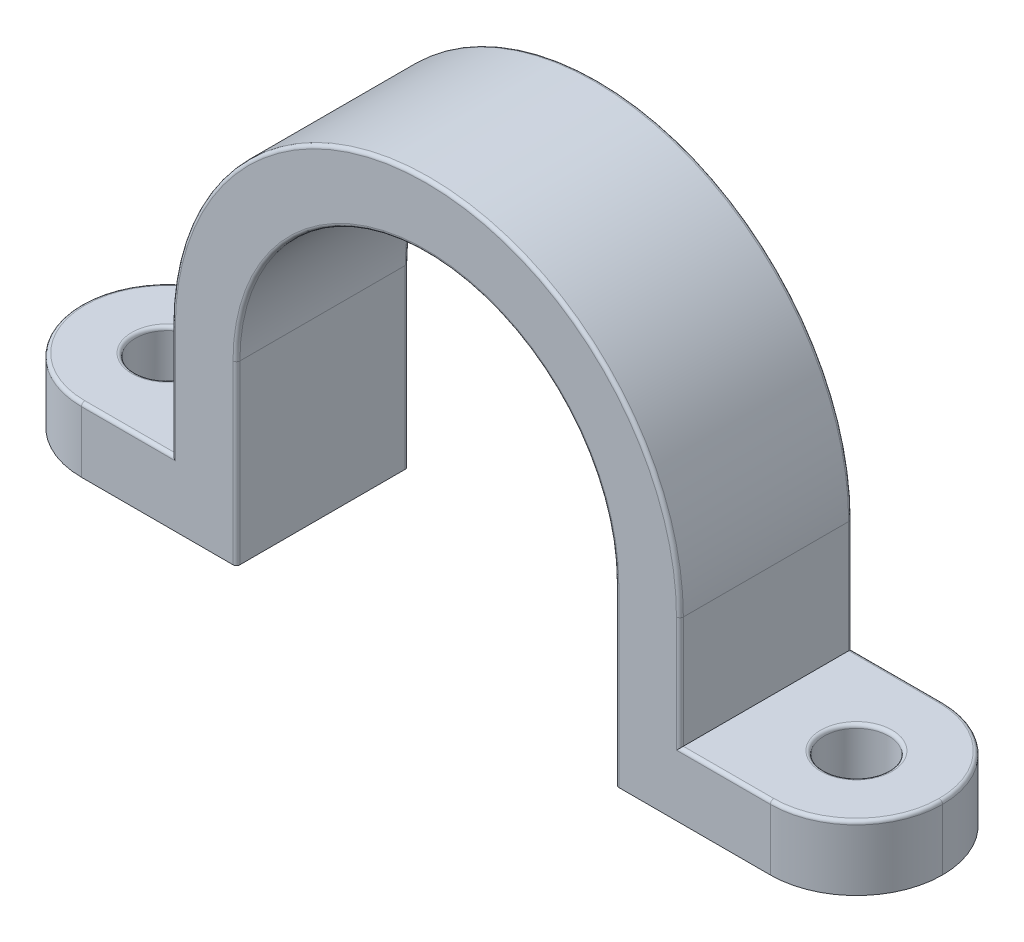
ISO-10303-21;
HEADER;
FILE_DESCRIPTION(('STEP AP214'),'2;1');
FILE_NAME('part.step','',(''),(''),'','','');
FILE_SCHEMA(('AUTOMOTIVE_DESIGN { 1 0 10303 214 1 1 1 1 }'));
ENDSEC;
DATA;
#1=APPLICATION_CONTEXT('core data for automotive mechanical design processes');
#2=APPLICATION_PROTOCOL_DEFINITION('international standard','automotive_design',2000,#1);
#3=PRODUCT_CONTEXT('',#1,'mechanical');
#4=PRODUCT('Part','Part','',(#3));
#5=PRODUCT_RELATED_PRODUCT_CATEGORY('part','',(#4));
#6=PRODUCT_DEFINITION_FORMATION('','',#4);
#7=PRODUCT_DEFINITION_CONTEXT('part definition',#1,'design');
#8=PRODUCT_DEFINITION('design','',#6,#7);
#9=PRODUCT_DEFINITION_SHAPE('','',#8);
#10=(LENGTH_UNIT() NAMED_UNIT(*) SI_UNIT(.MILLI.,.METRE.));
#11=(NAMED_UNIT(*) PLANE_ANGLE_UNIT() SI_UNIT($,.RADIAN.));
#12=(NAMED_UNIT(*) SI_UNIT($,.STERADIAN.) SOLID_ANGLE_UNIT());
#13=UNCERTAINTY_MEASURE_WITH_UNIT(LENGTH_MEASURE(1.E-05),#10,'distance_accuracy_value','');
#14=(GEOMETRIC_REPRESENTATION_CONTEXT(3) GLOBAL_UNCERTAINTY_ASSIGNED_CONTEXT((#13)) GLOBAL_UNIT_ASSIGNED_CONTEXT((#10,
#11,#12)) REPRESENTATION_CONTEXT('',''));
#15=CARTESIAN_POINT('',(0.,0.,0.));
#16=DIRECTION('',(0.,0.,1.));
#17=DIRECTION('',(1.,0.,0.));
#18=AXIS2_PLACEMENT_3D('',#15,#16,#17);
#19=CARTESIAN_POINT('',(-31.75,4.7625,-6.35));
#20=DIRECTION('',(0.,1.,0.));
#21=DIRECTION('',(0.,0.,1.));
#22=AXIS2_PLACEMENT_3D('',#19,#20,#21);
#23=PLANE('',#22);
#24=CARTESIAN_POINT('',(-25.4,4.7625,0.));
#25=DIRECTION('',(0.,1.,0.));
#26=DIRECTION('',(0.,0.,1.));
#27=AXIS2_PLACEMENT_3D('',#24,#25,#26);
#28=CIRCLE('',#27,2.63525);
#29=CARTESIAN_POINT('',(-25.4,4.7625,2.63525));
#30=VERTEX_POINT('',#29);
#31=EDGE_CURVE('E333',#30,#30,#28,.F.);
#32=ORIENTED_EDGE('',*,*,#31,.T.);
#33=EDGE_LOOP('',(#32));
#34=FACE_BOUND('',#33,.T.);
#35=DIRECTION('',(0.,0.,1.));
#36=VECTOR('',#35,1.);
#37=CARTESIAN_POINT('',(-18.7325,4.7625,-6.35));
#38=LINE('',#37,#36);
#39=CARTESIAN_POINT('',(-18.7325,4.7625,-6.096));
#40=VERTEX_POINT('',#39);
#41=CARTESIAN_POINT('',(-18.7325,4.7625,6.096));
#42=VERTEX_POINT('',#41);
#43=EDGE_CURVE('E434',#40,#42,#38,.T.);
#44=ORIENTED_EDGE('',*,*,#43,.F.);
#45=DIRECTION('',(-1.,0.,0.));
#46=VECTOR('',#45,1.);
#47=CARTESIAN_POINT('',(-31.75,4.7625,-6.096));
#48=LINE('',#47,#46);
#49=CARTESIAN_POINT('',(-25.4,4.7625,-6.096));
#50=VERTEX_POINT('',#49);
#51=EDGE_CURVE('E331',#40,#50,#48,.T.);
#52=ORIENTED_EDGE('',*,*,#51,.T.);
#53=CARTESIAN_POINT('',(-25.4,4.7625,0.));
#54=DIRECTION('',(0.,1.,0.));
#55=DIRECTION('',(0.,0.,1.));
#56=AXIS2_PLACEMENT_3D('',#53,#54,#55);
#57=CIRCLE('',#56,6.096);
#58=CARTESIAN_POINT('',(-31.496,4.7625,0.));
#59=VERTEX_POINT('',#58);
#60=EDGE_CURVE('E329',#50,#59,#57,.T.);
#61=ORIENTED_EDGE('',*,*,#60,.T.);
#62=CARTESIAN_POINT('',(-25.4,4.7625,0.));
#63=DIRECTION('',(0.,1.,0.));
#64=DIRECTION('',(0.,0.,1.));
#65=AXIS2_PLACEMENT_3D('',#62,#63,#64);
#66=CIRCLE('',#65,6.096);
#67=CARTESIAN_POINT('',(-25.4,4.7625,6.096));
#68=VERTEX_POINT('',#67);
#69=EDGE_CURVE('E327',#59,#68,#66,.T.);
#70=ORIENTED_EDGE('',*,*,#69,.T.);
#71=DIRECTION('',(-1.,0.,0.));
#72=VECTOR('',#71,1.);
#73=CARTESIAN_POINT('',(-18.7325,4.7625,6.096));
#74=LINE('',#73,#72);
#75=EDGE_CURVE('E325',#68,#42,#74,.F.);
#76=ORIENTED_EDGE('',*,*,#75,.T.);
#77=EDGE_LOOP('',(#44,#52,#61,#70,#76));
#78=FACE_BOUND('',#77,.T.);
#79=ADVANCED_FACE('F40',(#34,#78),#23,.T.);
#80=CARTESIAN_POINT('',(-18.7325,4.7625,-6.35));
#81=DIRECTION('',(-1.,0.,0.));
#82=DIRECTION('',(0.,0.,1.));
#83=AXIS2_PLACEMENT_3D('',#80,#81,#82);
#84=PLANE('',#83);
#85=DIRECTION('',(0.,0.,1.));
#86=VECTOR('',#85,1.);
#87=CARTESIAN_POINT('',(-18.7325,13.0175,-6.35));
#88=LINE('',#87,#86);
#89=CARTESIAN_POINT('',(-18.7325,13.0175,-6.096));
#90=VERTEX_POINT('',#89);
#91=CARTESIAN_POINT('',(-18.7325,13.0175,6.096));
#92=VERTEX_POINT('',#91);
#93=EDGE_CURVE('E437',#90,#92,#88,.T.);
#94=ORIENTED_EDGE('',*,*,#93,.F.);
#95=DIRECTION('',(0.,-1.,0.));
#96=VECTOR('',#95,1.);
#97=CARTESIAN_POINT('',(-18.7325,4.7625,-6.096));
#98=LINE('',#97,#96);
#99=EDGE_CURVE('E323',#90,#40,#98,.T.);
#100=ORIENTED_EDGE('',*,*,#99,.T.);
#101=ORIENTED_EDGE('',*,*,#43,.T.);
#102=DIRECTION('',(0.,-1.,0.));
#103=VECTOR('',#102,1.);
#104=CARTESIAN_POINT('',(-18.7325,13.0175,6.096));
#105=LINE('',#104,#103);
#106=EDGE_CURVE('E321',#42,#92,#105,.F.);
#107=ORIENTED_EDGE('',*,*,#106,.T.);
#108=EDGE_LOOP('',(#94,#100,#101,#107));
#109=FACE_BOUND('',#108,.T.);
#110=ADVANCED_FACE('F554',(#109),#84,.T.);
#111=CARTESIAN_POINT('',(0.,13.0175,-6.35));
#112=DIRECTION('',(0.,0.,1.));
#113=DIRECTION('',(1.,0.,0.));
#114=AXIS2_PLACEMENT_3D('',#111,#112,#113);
#115=CYLINDRICAL_SURFACE('',#114,18.7325);
#116=DIRECTION('',(0.,0.,1.));
#117=VECTOR('',#116,1.);
#118=CARTESIAN_POINT('',(18.7325,13.0175,-6.35));
#119=LINE('',#118,#117);
#120=CARTESIAN_POINT('',(18.7325,13.0175,-6.096));
#121=VERTEX_POINT('',#120);
#122=CARTESIAN_POINT('',(18.7325,13.0175,6.096));
#123=VERTEX_POINT('',#122);
#124=EDGE_CURVE('E440',#121,#123,#119,.T.);
#125=ORIENTED_EDGE('',*,*,#124,.F.);
#126=CARTESIAN_POINT('',(0.,13.0175,-6.096));
#127=DIRECTION('',(0.,0.,-1.));
#128=DIRECTION('',(-1.,0.,0.));
#129=AXIS2_PLACEMENT_3D('',#126,#127,#128);
#130=CIRCLE('',#129,18.7325);
#131=EDGE_CURVE('E11',#121,#90,#130,.F.);
#132=ORIENTED_EDGE('',*,*,#131,.T.);
#133=ORIENTED_EDGE('',*,*,#93,.T.);
#134=CARTESIAN_POINT('',(0.,13.0175,6.096));
#135=DIRECTION('',(0.,0.,-1.));
#136=DIRECTION('',(-1.,0.,0.));
#137=AXIS2_PLACEMENT_3D('',#134,#135,#136);
#138=CIRCLE('',#137,18.7325);
#139=EDGE_CURVE('E49',#92,#123,#138,.T.);
#140=ORIENTED_EDGE('',*,*,#139,.T.);
#141=EDGE_LOOP('',(#125,#132,#133,#140));
#142=FACE_BOUND('',#141,.T.);
#143=ADVANCED_FACE('F560',(#142),#115,.T.);
#144=CARTESIAN_POINT('',(18.7325,4.7625,-6.35));
#145=DIRECTION('',(1.,0.,0.));
#146=DIRECTION('',(0.,0.,-1.));
#147=AXIS2_PLACEMENT_3D('',#144,#145,#146);
#148=PLANE('',#147);
#149=DIRECTION('',(0.,0.,1.));
#150=VECTOR('',#149,1.);
#151=CARTESIAN_POINT('',(18.7325,4.7625,-6.35));
#152=LINE('',#151,#150);
#153=CARTESIAN_POINT('',(18.7325,4.7625,-6.096));
#154=VERTEX_POINT('',#153);
#155=CARTESIAN_POINT('',(18.7325,4.7625,6.096));
#156=VERTEX_POINT('',#155);
#157=EDGE_CURVE('E443',#154,#156,#152,.T.);
#158=ORIENTED_EDGE('',*,*,#157,.F.);
#159=DIRECTION('',(0.,1.,0.));
#160=VECTOR('',#159,1.);
#161=CARTESIAN_POINT('',(18.7325,4.7625,-6.096));
#162=LINE('',#161,#160);
#163=EDGE_CURVE('E319',#154,#121,#162,.T.);
#164=ORIENTED_EDGE('',*,*,#163,.T.);
#165=ORIENTED_EDGE('',*,*,#124,.T.);
#166=DIRECTION('',(0.,1.,0.));
#167=VECTOR('',#166,1.);
#168=CARTESIAN_POINT('',(18.7325,4.7625,6.096));
#169=LINE('',#168,#167);
#170=EDGE_CURVE('E317',#123,#156,#169,.F.);
#171=ORIENTED_EDGE('',*,*,#170,.T.);
#172=EDGE_LOOP('',(#158,#164,#165,#171));
#173=FACE_BOUND('',#172,.T.);
#174=ADVANCED_FACE('F568',(#173),#148,.T.);
#175=CARTESIAN_POINT('',(18.7325,4.7625,-6.35));
#176=DIRECTION('',(0.,1.,0.));
#177=DIRECTION('',(0.,0.,1.));
#178=AXIS2_PLACEMENT_3D('',#175,#176,#177);
#179=PLANE('',#178);
#180=CARTESIAN_POINT('',(25.4,4.7625,0.));
#181=DIRECTION('',(0.,1.,0.));
#182=DIRECTION('',(0.,0.,1.));
#183=AXIS2_PLACEMENT_3D('',#180,#181,#182);
#184=CIRCLE('',#183,2.63525);
#185=CARTESIAN_POINT('',(25.4,4.7625,2.63525));
#186=VERTEX_POINT('',#185);
#187=EDGE_CURVE('E282',#186,#186,#184,.F.);
#188=ORIENTED_EDGE('',*,*,#187,.T.);
#189=EDGE_LOOP('',(#188));
#190=FACE_BOUND('',#189,.T.);
#191=ORIENTED_EDGE('',*,*,#157,.T.);
#192=DIRECTION('',(-1.,0.,0.));
#193=VECTOR('',#192,1.);
#194=CARTESIAN_POINT('',(25.4,4.7625,6.096));
#195=LINE('',#194,#193);
#196=CARTESIAN_POINT('',(25.4,4.7625,6.096));
#197=VERTEX_POINT('',#196);
#198=EDGE_CURVE('E279',#156,#197,#195,.F.);
#199=ORIENTED_EDGE('',*,*,#198,.T.);
#200=CARTESIAN_POINT('',(25.4,4.7625,0.));
#201=DIRECTION('',(0.,1.,0.));
#202=DIRECTION('',(0.,0.,1.));
#203=AXIS2_PLACEMENT_3D('',#200,#201,#202);
#204=CIRCLE('',#203,6.096);
#205=CARTESIAN_POINT('',(31.496,4.7625,0.));
#206=VERTEX_POINT('',#205);
#207=EDGE_CURVE('E273',#197,#206,#204,.T.);
#208=ORIENTED_EDGE('',*,*,#207,.T.);
#209=CARTESIAN_POINT('',(25.4,4.7625,0.));
#210=DIRECTION('',(0.,1.,0.));
#211=DIRECTION('',(0.,0.,1.));
#212=AXIS2_PLACEMENT_3D('',#209,#210,#211);
#213=CIRCLE('',#212,6.096);
#214=CARTESIAN_POINT('',(25.4,4.7625,-6.096));
#215=VERTEX_POINT('',#214);
#216=EDGE_CURVE('E275',#206,#215,#213,.T.);
#217=ORIENTED_EDGE('',*,*,#216,.T.);
#218=DIRECTION('',(-1.,0.,0.));
#219=VECTOR('',#218,1.);
#220=CARTESIAN_POINT('',(18.7325,4.7625,-6.096));
#221=LINE('',#220,#219);
#222=EDGE_CURVE('E277',#215,#154,#221,.T.);
#223=ORIENTED_EDGE('',*,*,#222,.T.);
#224=EDGE_LOOP('',(#191,#199,#208,#217,#223));
#225=FACE_BOUND('',#224,.T.);
#226=ADVANCED_FACE('F572',(#190,#225),#179,.T.);
#227=CARTESIAN_POINT('',(13.97,0.,-6.35));
#228=DIRECTION('',(0.,-1.,0.));
#229=DIRECTION('',(0.,0.,-1.));
#230=AXIS2_PLACEMENT_3D('',#227,#228,#229);
#231=PLANE('',#230);
#232=CARTESIAN_POINT('',(25.4,0.,0.));
#233=DIRECTION('',(0.,-1.,0.));
#234=DIRECTION('',(0.,0.,-1.));
#235=AXIS2_PLACEMENT_3D('',#232,#233,#234);
#236=CIRCLE('',#235,2.63525);
#237=CARTESIAN_POINT('',(25.4,0.,-2.63525));
#238=VERTEX_POINT('',#237);
#239=EDGE_CURVE('E307',#238,#238,#236,.F.);
#240=ORIENTED_EDGE('',*,*,#239,.T.);
#241=EDGE_LOOP('',(#240));
#242=FACE_BOUND('',#241,.T.);
#243=DIRECTION('',(0.,0.,1.));
#244=VECTOR('',#243,1.);
#245=CARTESIAN_POINT('',(13.97,0.,-6.35));
#246=LINE('',#245,#244);
#247=CARTESIAN_POINT('',(13.97,0.,-6.096));
#248=VERTEX_POINT('',#247);
#249=CARTESIAN_POINT('',(13.97,0.,6.096));
#250=VERTEX_POINT('',#249);
#251=EDGE_CURVE('E446',#248,#250,#246,.T.);
#252=ORIENTED_EDGE('',*,*,#251,.F.);
#253=CARTESIAN_POINT('',(14.224,0.,-6.096));
#254=DIRECTION('',(0.,-1.,0.));
#255=DIRECTION('',(0.,0.,-1.));
#256=AXIS2_PLACEMENT_3D('',#253,#254,#255);
#257=CIRCLE('',#256,0.254);
#258=CARTESIAN_POINT('',(14.224,0.,-6.35));
#259=VERTEX_POINT('',#258);
#260=EDGE_CURVE('E218',#248,#259,#257,.T.);
#261=ORIENTED_EDGE('',*,*,#260,.T.);
#262=DIRECTION('',(1.,0.,0.));
#263=VECTOR('',#262,1.);
#264=CARTESIAN_POINT('',(13.97,0.,-6.35));
#265=LINE('',#264,#263);
#266=CARTESIAN_POINT('',(25.4,0.,-6.35));
#267=VERTEX_POINT('',#266);
#268=EDGE_CURVE('E210',#259,#267,#265,.T.);
#269=ORIENTED_EDGE('',*,*,#268,.T.);
#270=CARTESIAN_POINT('',(25.4,0.,0.));
#271=DIRECTION('',(0.,-1.,0.));
#272=DIRECTION('',(0.,0.,-1.));
#273=AXIS2_PLACEMENT_3D('',#270,#271,#272);
#274=CIRCLE('',#273,6.35);
#275=CARTESIAN_POINT('',(31.75,0.,0.));
#276=VERTEX_POINT('',#275);
#277=EDGE_CURVE('E216',#267,#276,#274,.T.);
#278=ORIENTED_EDGE('',*,*,#277,.T.);
#279=CARTESIAN_POINT('',(25.4,0.,0.));
#280=DIRECTION('',(0.,-1.,0.));
#281=DIRECTION('',(0.,0.,-1.));
#282=AXIS2_PLACEMENT_3D('',#279,#280,#281);
#283=CIRCLE('',#282,6.35);
#284=CARTESIAN_POINT('',(25.4,0.,6.35));
#285=VERTEX_POINT('',#284);
#286=EDGE_CURVE('E231',#276,#285,#283,.T.);
#287=ORIENTED_EDGE('',*,*,#286,.T.);
#288=DIRECTION('',(1.,0.,0.));
#289=VECTOR('',#288,1.);
#290=CARTESIAN_POINT('',(13.97,0.,6.35));
#291=LINE('',#290,#289);
#292=CARTESIAN_POINT('',(14.224,0.,6.35));
#293=VERTEX_POINT('',#292);
#294=EDGE_CURVE('E427',#293,#285,#291,.T.);
#295=ORIENTED_EDGE('',*,*,#294,.F.);
#296=CARTESIAN_POINT('',(14.224,0.,6.096));
#297=DIRECTION('',(0.,-1.,0.));
#298=DIRECTION('',(0.,0.,-1.));
#299=AXIS2_PLACEMENT_3D('',#296,#297,#298);
#300=CIRCLE('',#299,0.254);
#301=EDGE_CURVE('E310',#293,#250,#300,.T.);
#302=ORIENTED_EDGE('',*,*,#301,.T.);
#303=EDGE_LOOP('',(#252,#261,#269,#278,#287,#295,#302));
#304=FACE_BOUND('',#303,.T.);
#305=ADVANCED_FACE('F213',(#242,#304),#231,.T.);
#306=CARTESIAN_POINT('',(13.97,0.,-6.35));
#307=DIRECTION('',(-1.,0.,0.));
#308=DIRECTION('',(0.,0.,1.));
#309=AXIS2_PLACEMENT_3D('',#306,#307,#308);
#310=PLANE('',#309);
#311=DIRECTION('',(0.,0.,1.));
#312=VECTOR('',#311,1.);
#313=CARTESIAN_POINT('',(13.97,13.0175,-6.35));
#314=LINE('',#313,#312);
#315=CARTESIAN_POINT('',(13.97,13.0175,-6.096));
#316=VERTEX_POINT('',#315);
#317=CARTESIAN_POINT('',(13.97,13.0175,6.096));
#318=VERTEX_POINT('',#317);
#319=EDGE_CURVE('E448',#316,#318,#314,.T.);
#320=ORIENTED_EDGE('',*,*,#319,.F.);
#321=DIRECTION('',(0.,-1.,0.));
#322=VECTOR('',#321,1.);
#323=CARTESIAN_POINT('',(13.97,0.,-6.096));
#324=LINE('',#323,#322);
#325=EDGE_CURVE('E304',#316,#248,#324,.T.);
#326=ORIENTED_EDGE('',*,*,#325,.T.);
#327=ORIENTED_EDGE('',*,*,#251,.T.);
#328=DIRECTION('',(0.,-1.,0.));
#329=VECTOR('',#328,1.);
#330=CARTESIAN_POINT('',(13.97,13.0175,6.096));
#331=LINE('',#330,#329);
#332=EDGE_CURVE('E302',#250,#318,#331,.F.);
#333=ORIENTED_EDGE('',*,*,#332,.T.);
#334=EDGE_LOOP('',(#320,#326,#327,#333));
#335=FACE_BOUND('',#334,.T.);
#336=ADVANCED_FACE('F579',(#335),#310,.T.);
#337=CARTESIAN_POINT('',(0.,13.0175,-6.35));
#338=DIRECTION('',(0.,0.,1.));
#339=DIRECTION('',(1.,0.,0.));
#340=AXIS2_PLACEMENT_3D('',#337,#338,#339);
#341=CYLINDRICAL_SURFACE('',#340,13.97);
#342=DIRECTION('',(0.,0.,1.));
#343=VECTOR('',#342,1.);
#344=CARTESIAN_POINT('',(-13.97,13.0175,-6.35));
#345=LINE('',#344,#343);
#346=CARTESIAN_POINT('',(-13.97,13.0175,-6.096));
#347=VERTEX_POINT('',#346);
#348=CARTESIAN_POINT('',(-13.97,13.0175,6.096));
#349=VERTEX_POINT('',#348);
#350=EDGE_CURVE('E451',#347,#349,#345,.T.);
#351=ORIENTED_EDGE('',*,*,#350,.F.);
#352=CARTESIAN_POINT('',(0.,13.0175,-6.096));
#353=DIRECTION('',(0.,0.,-1.));
#354=DIRECTION('',(-1.,0.,0.));
#355=AXIS2_PLACEMENT_3D('',#352,#353,#354);
#356=CIRCLE('',#355,13.97);
#357=EDGE_CURVE('E315',#347,#316,#356,.T.);
#358=ORIENTED_EDGE('',*,*,#357,.T.);
#359=ORIENTED_EDGE('',*,*,#319,.T.);
#360=CARTESIAN_POINT('',(0.,13.0175,6.096));
#361=DIRECTION('',(0.,0.,-1.));
#362=DIRECTION('',(-1.,0.,0.));
#363=AXIS2_PLACEMENT_3D('',#360,#361,#362);
#364=CIRCLE('',#363,13.97);
#365=EDGE_CURVE('E313',#318,#349,#364,.F.);
#366=ORIENTED_EDGE('',*,*,#365,.T.);
#367=EDGE_LOOP('',(#351,#358,#359,#366));
#368=FACE_BOUND('',#367,.T.);
#369=ADVANCED_FACE('F583',(#368),#341,.F.);
#370=CARTESIAN_POINT('',(-13.97,0.,-6.35));
#371=DIRECTION('',(1.,0.,0.));
#372=DIRECTION('',(0.,0.,-1.));
#373=AXIS2_PLACEMENT_3D('',#370,#371,#372);
#374=PLANE('',#373);
#375=ORIENTED_EDGE('',*,*,#350,.T.);
#376=DIRECTION('',(0.,1.,0.));
#377=VECTOR('',#376,1.);
#378=CARTESIAN_POINT('',(-13.97,0.,6.096));
#379=LINE('',#378,#377);
#380=CARTESIAN_POINT('',(-13.97,0.,6.096));
#381=VERTEX_POINT('',#380);
#382=EDGE_CURVE('E57',#349,#381,#379,.F.);
#383=ORIENTED_EDGE('',*,*,#382,.T.);
#384=DIRECTION('',(0.,0.,1.));
#385=VECTOR('',#384,1.);
#386=CARTESIAN_POINT('',(-13.97,0.,-6.35));
#387=LINE('',#386,#385);
#388=CARTESIAN_POINT('',(-13.97,0.,-6.096));
#389=VERTEX_POINT('',#388);
#390=EDGE_CURVE('E221',#389,#381,#387,.T.);
#391=ORIENTED_EDGE('',*,*,#390,.F.);
#392=DIRECTION('',(0.,1.,0.));
#393=VECTOR('',#392,1.);
#394=CARTESIAN_POINT('',(-13.97,0.,-6.096));
#395=LINE('',#394,#393);
#396=EDGE_CURVE('E340',#389,#347,#395,.T.);
#397=ORIENTED_EDGE('',*,*,#396,.T.);
#398=EDGE_LOOP('',(#375,#383,#391,#397));
#399=FACE_BOUND('',#398,.T.);
#400=ADVANCED_FACE('F587',(#399),#374,.T.);
#401=CARTESIAN_POINT('',(-31.75,0.,-6.35));
#402=DIRECTION('',(0.,-1.,0.));
#403=DIRECTION('',(0.,0.,-1.));
#404=AXIS2_PLACEMENT_3D('',#401,#402,#403);
#405=PLANE('',#404);
#406=CARTESIAN_POINT('',(-25.4,0.,0.));
#407=DIRECTION('',(0.,-1.,0.));
#408=DIRECTION('',(0.,0.,-1.));
#409=AXIS2_PLACEMENT_3D('',#406,#407,#408);
#410=CIRCLE('',#409,2.63525);
#411=CARTESIAN_POINT('',(-25.4,0.,-2.63525));
#412=VERTEX_POINT('',#411);
#413=EDGE_CURVE('E344',#412,#412,#410,.F.);
#414=ORIENTED_EDGE('',*,*,#413,.T.);
#415=EDGE_LOOP('',(#414));
#416=FACE_BOUND('',#415,.T.);
#417=ORIENTED_EDGE('',*,*,#390,.T.);
#418=CARTESIAN_POINT('',(-14.224,0.,6.096));
#419=DIRECTION('',(0.,-1.,0.));
#420=DIRECTION('',(0.,0.,-1.));
#421=AXIS2_PLACEMENT_3D('',#418,#419,#420);
#422=CIRCLE('',#421,0.254);
#423=CARTESIAN_POINT('',(-14.224,0.,6.35));
#424=VERTEX_POINT('',#423);
#425=EDGE_CURVE('E347',#381,#424,#422,.T.);
#426=ORIENTED_EDGE('',*,*,#425,.T.);
#427=DIRECTION('',(1.,0.,0.));
#428=VECTOR('',#427,1.);
#429=CARTESIAN_POINT('',(-31.75,0.,6.35));
#430=LINE('',#429,#428);
#431=CARTESIAN_POINT('',(-25.4,0.,6.35));
#432=VERTEX_POINT('',#431);
#433=EDGE_CURVE('E251',#432,#424,#430,.T.);
#434=ORIENTED_EDGE('',*,*,#433,.F.);
#435=CARTESIAN_POINT('',(-25.4,0.,0.));
#436=DIRECTION('',(0.,-1.,0.));
#437=DIRECTION('',(0.,0.,-1.));
#438=AXIS2_PLACEMENT_3D('',#435,#436,#437);
#439=CIRCLE('',#438,6.35);
#440=CARTESIAN_POINT('',(-31.75,0.,0.));
#441=VERTEX_POINT('',#440);
#442=EDGE_CURVE('E245',#432,#441,#439,.T.);
#443=ORIENTED_EDGE('',*,*,#442,.T.);
#444=CARTESIAN_POINT('',(-25.4,0.,0.));
#445=DIRECTION('',(0.,-1.,0.));
#446=DIRECTION('',(0.,0.,-1.));
#447=AXIS2_PLACEMENT_3D('',#444,#445,#446);
#448=CIRCLE('',#447,6.35);
#449=CARTESIAN_POINT('',(-25.4,0.,-6.35));
#450=VERTEX_POINT('',#449);
#451=EDGE_CURVE('E247',#441,#450,#448,.T.);
#452=ORIENTED_EDGE('',*,*,#451,.T.);
#453=DIRECTION('',(1.,0.,0.));
#454=VECTOR('',#453,1.);
#455=CARTESIAN_POINT('',(-31.75,0.,-6.35));
#456=LINE('',#455,#454);
#457=CARTESIAN_POINT('',(-14.224,0.,-6.35));
#458=VERTEX_POINT('',#457);
#459=EDGE_CURVE('E222',#450,#458,#456,.T.);
#460=ORIENTED_EDGE('',*,*,#459,.T.);
#461=CARTESIAN_POINT('',(-14.224,0.,-6.096));
#462=DIRECTION('',(0.,-1.,0.));
#463=DIRECTION('',(0.,0.,-1.));
#464=AXIS2_PLACEMENT_3D('',#461,#462,#463);
#465=CIRCLE('',#464,0.254);
#466=EDGE_CURVE('E64',#458,#389,#465,.T.);
#467=ORIENTED_EDGE('',*,*,#466,.T.);
#468=EDGE_LOOP('',(#417,#426,#434,#443,#452,#460,#467));
#469=FACE_BOUND('',#468,.T.);
#470=ADVANCED_FACE('F537',(#416,#469),#405,.T.);
#471=CARTESIAN_POINT('',(0.,13.0175,-6.35));
#472=DIRECTION('',(0.,0.,-1.));
#473=DIRECTION('',(-1.,0.,0.));
#474=AXIS2_PLACEMENT_3D('',#471,#472,#473);
#475=PLANE('',#474);
#476=ORIENTED_EDGE('',*,*,#268,.F.);
#477=DIRECTION('',(0.,-1.,0.));
#478=VECTOR('',#477,1.);
#479=CARTESIAN_POINT('',(14.224,13.0175,-6.35));
#480=LINE('',#479,#478);
#481=CARTESIAN_POINT('',(14.224,13.0175,-6.35));
#482=VERTEX_POINT('',#481);
#483=EDGE_CURVE('E298',#259,#482,#480,.F.);
#484=ORIENTED_EDGE('',*,*,#483,.T.);
#485=CARTESIAN_POINT('',(0.,13.0175,-6.35));
#486=DIRECTION('',(0.,0.,-1.));
#487=DIRECTION('',(-1.,0.,0.));
#488=AXIS2_PLACEMENT_3D('',#485,#486,#487);
#489=CIRCLE('',#488,14.224);
#490=CARTESIAN_POINT('',(-14.224,13.0175,-6.35));
#491=VERTEX_POINT('',#490);
#492=EDGE_CURVE('E296',#482,#491,#489,.F.);
#493=ORIENTED_EDGE('',*,*,#492,.T.);
#494=DIRECTION('',(0.,1.,0.));
#495=VECTOR('',#494,1.);
#496=CARTESIAN_POINT('',(-14.224,13.0175,-6.35));
#497=LINE('',#496,#495);
#498=EDGE_CURVE('E294',#491,#458,#497,.F.);
#499=ORIENTED_EDGE('',*,*,#498,.T.);
#500=ORIENTED_EDGE('',*,*,#459,.F.);
#501=DIRECTION('',(0.,-1.,0.));
#502=VECTOR('',#501,1.);
#503=CARTESIAN_POINT('',(-25.4,13.0175,-6.35));
#504=LINE('',#503,#502);
#505=CARTESIAN_POINT('',(-25.4,4.5085,-6.35));
#506=VERTEX_POINT('',#505);
#507=EDGE_CURVE('E232',#450,#506,#504,.F.);
#508=ORIENTED_EDGE('',*,*,#507,.T.);
#509=DIRECTION('',(-1.,0.,0.));
#510=VECTOR('',#509,1.);
#511=CARTESIAN_POINT('',(0.,4.5085,-6.35));
#512=LINE('',#511,#510);
#513=CARTESIAN_POINT('',(-18.4785,4.5085,-6.35));
#514=VERTEX_POINT('',#513);
#515=EDGE_CURVE('E292',#506,#514,#512,.F.);
#516=ORIENTED_EDGE('',*,*,#515,.T.);
#517=DIRECTION('',(0.,-1.,0.));
#518=VECTOR('',#517,1.);
#519=CARTESIAN_POINT('',(-18.4785,13.0175,-6.35));
#520=LINE('',#519,#518);
#521=CARTESIAN_POINT('',(-18.4785,13.0175,-6.35));
#522=VERTEX_POINT('',#521);
#523=EDGE_CURVE('E287',#514,#522,#520,.F.);
#524=ORIENTED_EDGE('',*,*,#523,.T.);
#525=CARTESIAN_POINT('',(0.,13.0175,-6.35));
#526=DIRECTION('',(0.,0.,-1.));
#527=DIRECTION('',(-1.,0.,0.));
#528=AXIS2_PLACEMENT_3D('',#525,#526,#527);
#529=CIRCLE('',#528,18.4785);
#530=CARTESIAN_POINT('',(18.4785,13.0175,-6.35));
#531=VERTEX_POINT('',#530);
#532=EDGE_CURVE('E285',#522,#531,#529,.T.);
#533=ORIENTED_EDGE('',*,*,#532,.T.);
#534=DIRECTION('',(0.,1.,0.));
#535=VECTOR('',#534,1.);
#536=CARTESIAN_POINT('',(18.4785,13.0175,-6.35));
#537=LINE('',#536,#535);
#538=CARTESIAN_POINT('',(18.4785,4.5085,-6.35));
#539=VERTEX_POINT('',#538);
#540=EDGE_CURVE('E289',#531,#539,#537,.F.);
#541=ORIENTED_EDGE('',*,*,#540,.T.);
#542=DIRECTION('',(-1.,0.,0.));
#543=VECTOR('',#542,1.);
#544=CARTESIAN_POINT('',(0.,4.5085,-6.35));
#545=LINE('',#544,#543);
#546=CARTESIAN_POINT('',(25.4,4.5085,-6.35));
#547=VERTEX_POINT('',#546);
#548=EDGE_CURVE('E228',#539,#547,#545,.F.);
#549=ORIENTED_EDGE('',*,*,#548,.T.);
#550=DIRECTION('',(0.,1.,0.));
#551=VECTOR('',#550,1.);
#552=CARTESIAN_POINT('',(25.4,13.0175,-6.35));
#553=LINE('',#552,#551);
#554=EDGE_CURVE('E225',#547,#267,#553,.F.);
#555=ORIENTED_EDGE('',*,*,#554,.T.);
#556=EDGE_LOOP('',(#476,#484,#493,#499,#500,#508,#516,#524,#533,#541,#549,#555));
#557=FACE_BOUND('',#556,.T.);
#558=ADVANCED_FACE('F226',(#557),#475,.T.);
#559=CARTESIAN_POINT('',(0.,13.0175,6.35));
#560=DIRECTION('',(0.,0.,-1.));
#561=DIRECTION('',(-1.,0.,0.));
#562=AXIS2_PLACEMENT_3D('',#559,#560,#561);
#563=PLANE('',#562);
#564=ORIENTED_EDGE('',*,*,#433,.T.);
#565=DIRECTION('',(0.,1.,0.));
#566=VECTOR('',#565,1.);
#567=CARTESIAN_POINT('',(-14.224,13.0175,6.35));
#568=LINE('',#567,#566);
#569=CARTESIAN_POINT('',(-14.224,13.0175,6.35));
#570=VERTEX_POINT('',#569);
#571=EDGE_CURVE('E270',#424,#570,#568,.T.);
#572=ORIENTED_EDGE('',*,*,#571,.T.);
#573=CARTESIAN_POINT('',(0.,13.0175,6.35));
#574=DIRECTION('',(0.,0.,-1.));
#575=DIRECTION('',(-1.,0.,0.));
#576=AXIS2_PLACEMENT_3D('',#573,#574,#575);
#577=CIRCLE('',#576,14.224);
#578=CARTESIAN_POINT('',(14.224,13.0175,6.35));
#579=VERTEX_POINT('',#578);
#580=EDGE_CURVE('E266',#570,#579,#577,.T.);
#581=ORIENTED_EDGE('',*,*,#580,.T.);
#582=DIRECTION('',(0.,-1.,0.));
#583=VECTOR('',#582,1.);
#584=CARTESIAN_POINT('',(14.224,0.,6.35));
#585=LINE('',#584,#583);
#586=EDGE_CURVE('E268',#579,#293,#585,.T.);
#587=ORIENTED_EDGE('',*,*,#586,.T.);
#588=ORIENTED_EDGE('',*,*,#294,.T.);
#589=DIRECTION('',(0.,1.,0.));
#590=VECTOR('',#589,1.);
#591=CARTESIAN_POINT('',(25.4,4.7625,6.35));
#592=LINE('',#591,#590);
#593=CARTESIAN_POINT('',(25.4,4.5085,6.35));
#594=VERTEX_POINT('',#593);
#595=EDGE_CURVE('E239',#285,#594,#592,.T.);
#596=ORIENTED_EDGE('',*,*,#595,.T.);
#597=DIRECTION('',(-1.,0.,0.));
#598=VECTOR('',#597,1.);
#599=CARTESIAN_POINT('',(18.7325,4.5085,6.35));
#600=LINE('',#599,#598);
#601=CARTESIAN_POINT('',(18.4785,4.5085,6.35));
#602=VERTEX_POINT('',#601);
#603=EDGE_CURVE('E261',#594,#602,#600,.T.);
#604=ORIENTED_EDGE('',*,*,#603,.T.);
#605=DIRECTION('',(0.,1.,0.));
#606=VECTOR('',#605,1.);
#607=CARTESIAN_POINT('',(18.4785,13.0175,6.35));
#608=LINE('',#607,#606);
#609=CARTESIAN_POINT('',(18.4785,13.0175,6.35));
#610=VERTEX_POINT('',#609);
#611=EDGE_CURVE('E259',#602,#610,#608,.T.);
#612=ORIENTED_EDGE('',*,*,#611,.T.);
#613=CARTESIAN_POINT('',(0.,13.0175,6.35));
#614=DIRECTION('',(0.,0.,-1.));
#615=DIRECTION('',(-1.,0.,0.));
#616=AXIS2_PLACEMENT_3D('',#613,#614,#615);
#617=CIRCLE('',#616,18.4785);
#618=CARTESIAN_POINT('',(-18.4785,13.0175,6.35));
#619=VERTEX_POINT('',#618);
#620=EDGE_CURVE('E249',#610,#619,#617,.F.);
#621=ORIENTED_EDGE('',*,*,#620,.T.);
#622=DIRECTION('',(0.,-1.,0.));
#623=VECTOR('',#622,1.);
#624=CARTESIAN_POINT('',(-18.4785,4.7625,6.35));
#625=LINE('',#624,#623);
#626=CARTESIAN_POINT('',(-18.4785,4.5085,6.35));
#627=VERTEX_POINT('',#626);
#628=EDGE_CURVE('E257',#619,#627,#625,.T.);
#629=ORIENTED_EDGE('',*,*,#628,.T.);
#630=DIRECTION('',(-1.,0.,0.));
#631=VECTOR('',#630,1.);
#632=CARTESIAN_POINT('',(-25.4,4.5085,6.35));
#633=LINE('',#632,#631);
#634=CARTESIAN_POINT('',(-25.4,4.5085,6.35));
#635=VERTEX_POINT('',#634);
#636=EDGE_CURVE('E264',#627,#635,#633,.T.);
#637=ORIENTED_EDGE('',*,*,#636,.T.);
#638=DIRECTION('',(0.,-1.,0.));
#639=VECTOR('',#638,1.);
#640=CARTESIAN_POINT('',(-25.4,0.,6.35));
#641=LINE('',#640,#639);
#642=EDGE_CURVE('E237',#635,#432,#641,.T.);
#643=ORIENTED_EDGE('',*,*,#642,.T.);
#644=EDGE_LOOP('',(#564,#572,#581,#587,#588,#596,#604,#612,#621,#629,#637,#643));
#645=FACE_BOUND('',#644,.T.);
#646=ADVANCED_FACE('F426',(#645),#563,.F.);
#647=CARTESIAN_POINT('',(25.4,13.0175,0.));
#648=DIRECTION('',(0.,-1.,0.));
#649=DIRECTION('',(0.,0.,-1.));
#650=AXIS2_PLACEMENT_3D('',#647,#648,#649);
#651=CYLINDRICAL_SURFACE('',#650,6.35);
#652=DIRECTION('',(0.,1.,0.));
#653=VECTOR('',#652,1.);
#654=CARTESIAN_POINT('',(31.75,0.,0.));
#655=LINE('',#654,#653);
#656=CARTESIAN_POINT('',(31.75,4.5085,0.));
#657=VERTEX_POINT('',#656);
#658=EDGE_CURVE('E236',#657,#276,#655,.F.);
#659=ORIENTED_EDGE('',*,*,#658,.F.);
#660=CARTESIAN_POINT('',(25.4,4.5085,0.));
#661=DIRECTION('',(0.,1.,0.));
#662=DIRECTION('',(0.,0.,1.));
#663=AXIS2_PLACEMENT_3D('',#660,#661,#662);
#664=CIRCLE('',#663,6.35);
#665=EDGE_CURVE('E361',#657,#594,#664,.F.);
#666=ORIENTED_EDGE('',*,*,#665,.T.);
#667=ORIENTED_EDGE('',*,*,#595,.F.);
#668=ORIENTED_EDGE('',*,*,#286,.F.);
#669=EDGE_LOOP('',(#659,#666,#667,#668));
#670=FACE_BOUND('',#669,.T.);
#671=ADVANCED_FACE('F499',(#670),#651,.T.);
#672=CARTESIAN_POINT('',(25.4,0.,0.));
#673=DIRECTION('',(0.,1.,0.));
#674=DIRECTION('',(0.,0.,1.));
#675=AXIS2_PLACEMENT_3D('',#672,#673,#674);
#676=CYLINDRICAL_SURFACE('',#675,6.35);
#677=ORIENTED_EDGE('',*,*,#554,.F.);
#678=CARTESIAN_POINT('',(25.4,4.5085,0.));
#679=DIRECTION('',(0.,1.,0.));
#680=DIRECTION('',(0.,0.,1.));
#681=AXIS2_PLACEMENT_3D('',#678,#679,#680);
#682=CIRCLE('',#681,6.35);
#683=EDGE_CURVE('E300',#547,#657,#682,.F.);
#684=ORIENTED_EDGE('',*,*,#683,.T.);
#685=ORIENTED_EDGE('',*,*,#658,.T.);
#686=ORIENTED_EDGE('',*,*,#277,.F.);
#687=EDGE_LOOP('',(#677,#684,#685,#686));
#688=FACE_BOUND('',#687,.T.);
#689=ADVANCED_FACE('F234',(#688),#676,.T.);
#690=CARTESIAN_POINT('',(-25.4,13.0175,0.));
#691=DIRECTION('',(0.,1.,0.));
#692=DIRECTION('',(0.,0.,1.));
#693=AXIS2_PLACEMENT_3D('',#690,#691,#692);
#694=CYLINDRICAL_SURFACE('',#693,6.35);
#695=ORIENTED_EDGE('',*,*,#642,.F.);
#696=CARTESIAN_POINT('',(-25.4,4.5085,0.));
#697=DIRECTION('',(0.,1.,0.));
#698=DIRECTION('',(0.,0.,1.));
#699=AXIS2_PLACEMENT_3D('',#696,#697,#698);
#700=CIRCLE('',#699,6.35);
#701=CARTESIAN_POINT('',(-31.75,4.5085,0.));
#702=VERTEX_POINT('',#701);
#703=EDGE_CURVE('E338',#635,#702,#700,.F.);
#704=ORIENTED_EDGE('',*,*,#703,.T.);
#705=DIRECTION('',(0.,-1.,0.));
#706=VECTOR('',#705,1.);
#707=CARTESIAN_POINT('',(-31.75,4.7625,0.));
#708=LINE('',#707,#706);
#709=EDGE_CURVE('E252',#441,#702,#708,.F.);
#710=ORIENTED_EDGE('',*,*,#709,.F.);
#711=ORIENTED_EDGE('',*,*,#442,.F.);
#712=EDGE_LOOP('',(#695,#704,#710,#711));
#713=FACE_BOUND('',#712,.T.);
#714=ADVANCED_FACE('F534',(#713),#694,.T.);
#715=CARTESIAN_POINT('',(-25.4,0.,0.));
#716=DIRECTION('',(0.,-1.,0.));
#717=DIRECTION('',(0.,0.,-1.));
#718=AXIS2_PLACEMENT_3D('',#715,#716,#717);
#719=CYLINDRICAL_SURFACE('',#718,6.35);
#720=ORIENTED_EDGE('',*,*,#709,.T.);
#721=CARTESIAN_POINT('',(-25.4,4.5085,0.));
#722=DIRECTION('',(0.,1.,0.));
#723=DIRECTION('',(0.,0.,1.));
#724=AXIS2_PLACEMENT_3D('',#721,#722,#723);
#725=CIRCLE('',#724,6.35);
#726=EDGE_CURVE('E336',#702,#506,#725,.F.);
#727=ORIENTED_EDGE('',*,*,#726,.T.);
#728=ORIENTED_EDGE('',*,*,#507,.F.);
#729=ORIENTED_EDGE('',*,*,#451,.F.);
#730=EDGE_LOOP('',(#720,#727,#728,#729));
#731=FACE_BOUND('',#730,.T.);
#732=ADVANCED_FACE('F536',(#731),#719,.T.);
#733=CARTESIAN_POINT('',(-25.4,-6.73519209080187,0.));
#734=DIRECTION('',(0.,1.,0.));
#735=DIRECTION('',(0.,0.,1.));
#736=AXIS2_PLACEMENT_3D('',#733,#734,#735);
#737=CYLINDRICAL_SURFACE('',#736,2.38125);
#738=CARTESIAN_POINT('',(-25.4,0.254,0.));
#739=DIRECTION('',(0.,-1.,0.));
#740=DIRECTION('',(0.,0.,-1.));
#741=AXIS2_PLACEMENT_3D('',#738,#739,#740);
#742=CIRCLE('',#741,2.38125);
#743=CARTESIAN_POINT('',(-25.4,0.254000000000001,2.38125));
#744=VERTEX_POINT('',#743);
#745=EDGE_CURVE('E358',#744,#744,#742,.T.);
#746=CARTESIAN_POINT('',(-25.4,4.5085,0.));
#747=DIRECTION('',(0.,1.,0.));
#748=DIRECTION('',(0.,0.,1.));
#749=AXIS2_PLACEMENT_3D('',#746,#747,#748);
#750=CIRCLE('',#749,2.38125);
#751=CARTESIAN_POINT('',(-25.4,4.5085,2.38125));
#752=VERTEX_POINT('',#751);
#753=EDGE_CURVE('E355',#752,#752,#750,.T.);
#754=CARTESIAN_POINT('',(-25.4,0.254000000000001,2.38125));
#755=CARTESIAN_POINT('',(-25.4,0.298317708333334,2.38125));
#756=CARTESIAN_POINT('',(-25.4,0.342635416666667,2.38125));
#757=CARTESIAN_POINT('',(-25.4,0.431270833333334,2.38125));
#758=CARTESIAN_POINT('',(-25.4,0.475588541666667,2.38125));
#759=CARTESIAN_POINT('',(-25.4,0.564223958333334,2.38125));
#760=CARTESIAN_POINT('',(-25.4,0.608541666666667,2.38125));
#761=CARTESIAN_POINT('',(-25.4,0.697177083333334,2.38125));
#762=CARTESIAN_POINT('',(-25.4,0.741494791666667,2.38125));
#763=CARTESIAN_POINT('',(-25.4,0.830130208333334,2.38125));
#764=CARTESIAN_POINT('',(-25.4,0.874447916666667,2.38125));
#765=CARTESIAN_POINT('',(-25.4,0.963083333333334,2.38125));
#766=CARTESIAN_POINT('',(-25.4,1.00740104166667,2.38125));
#767=CARTESIAN_POINT('',(-25.4,1.09603645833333,2.38125));
#768=CARTESIAN_POINT('',(-25.4,1.14035416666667,2.38125));
#769=CARTESIAN_POINT('',(-25.4,1.22898958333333,2.38125));
#770=CARTESIAN_POINT('',(-25.4,1.27330729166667,2.38125));
#771=CARTESIAN_POINT('',(-25.4,1.36194270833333,2.38125));
#772=CARTESIAN_POINT('',(-25.4,1.40626041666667,2.38125));
#773=CARTESIAN_POINT('',(-25.4,1.49489583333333,2.38125));
#774=CARTESIAN_POINT('',(-25.4,1.53921354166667,2.38125));
#775=CARTESIAN_POINT('',(-25.4,1.62784895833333,2.38125));
#776=CARTESIAN_POINT('',(-25.4,1.67216666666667,2.38125));
#777=CARTESIAN_POINT('',(-25.4,1.76080208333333,2.38125));
#778=CARTESIAN_POINT('',(-25.4,1.80511979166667,2.38125));
#779=CARTESIAN_POINT('',(-25.4,1.89375520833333,2.38125));
#780=CARTESIAN_POINT('',(-25.4,1.93807291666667,2.38125));
#781=CARTESIAN_POINT('',(-25.4,2.02670833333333,2.38125));
#782=CARTESIAN_POINT('',(-25.4,2.07102604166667,2.38125));
#783=CARTESIAN_POINT('',(-25.4,2.15966145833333,2.38125));
#784=CARTESIAN_POINT('',(-25.4,2.20397916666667,2.38125));
#785=CARTESIAN_POINT('',(-25.4,2.29261458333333,2.38125));
#786=CARTESIAN_POINT('',(-25.4,2.33693229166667,2.38125));
#787=CARTESIAN_POINT('',(-25.4,2.42556770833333,2.38125));
#788=CARTESIAN_POINT('',(-25.4,2.46988541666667,2.38125));
#789=CARTESIAN_POINT('',(-25.4,2.55852083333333,2.38125));
#790=CARTESIAN_POINT('',(-25.4,2.60283854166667,2.38125));
#791=CARTESIAN_POINT('',(-25.4,2.69147395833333,2.38125));
#792=CARTESIAN_POINT('',(-25.4,2.73579166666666,2.38125));
#793=CARTESIAN_POINT('',(-25.4,2.82442708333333,2.38125));
#794=CARTESIAN_POINT('',(-25.4,2.86874479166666,2.38125));
#795=CARTESIAN_POINT('',(-25.4,2.95738020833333,2.38125));
#796=CARTESIAN_POINT('',(-25.4,3.00169791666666,2.38125));
#797=CARTESIAN_POINT('',(-25.4,3.09033333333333,2.38125));
#798=CARTESIAN_POINT('',(-25.4,3.13465104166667,2.38125));
#799=CARTESIAN_POINT('',(-25.4,3.22328645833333,2.38125));
#800=CARTESIAN_POINT('',(-25.4,3.26760416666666,2.38125));
#801=CARTESIAN_POINT('',(-25.4,3.35623958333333,2.38125));
#802=CARTESIAN_POINT('',(-25.4,3.40055729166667,2.38125));
#803=CARTESIAN_POINT('',(-25.4,3.48919270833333,2.38125));
#804=CARTESIAN_POINT('',(-25.4,3.53351041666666,2.38125));
#805=CARTESIAN_POINT('',(-25.4,3.62214583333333,2.38125));
#806=CARTESIAN_POINT('',(-25.4,3.66646354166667,2.38125));
#807=CARTESIAN_POINT('',(-25.4,3.75509895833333,2.38125));
#808=CARTESIAN_POINT('',(-25.4,3.79941666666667,2.38125));
#809=CARTESIAN_POINT('',(-25.4,3.88805208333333,2.38125));
#810=CARTESIAN_POINT('',(-25.4,3.93236979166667,2.38125));
#811=CARTESIAN_POINT('',(-25.4,4.02100520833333,2.38125));
#812=CARTESIAN_POINT('',(-25.4,4.06532291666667,2.38125));
#813=CARTESIAN_POINT('',(-25.4,4.15395833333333,2.38125));
#814=CARTESIAN_POINT('',(-25.4,4.19827604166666,2.38125));
#815=CARTESIAN_POINT('',(-25.4,4.28691145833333,2.38125));
#816=CARTESIAN_POINT('',(-25.4,4.33122916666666,2.38125));
#817=CARTESIAN_POINT('',(-25.4,4.41986458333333,2.38125));
#818=CARTESIAN_POINT('',(-25.4,4.46418229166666,2.38125));
#819=CARTESIAN_POINT('',(-25.4,4.5085,2.38125));
#820=B_SPLINE_CURVE_WITH_KNOTS('',3,(#754,#755,#756,#757,#758,#759,#760,#761,#762,#763,#764,
#765,#766,#767,#768,#769,#770,#771,#772,#773,#774,#775,#776,#777,#778,#779,#780,#781,#782,#783,
#784,#785,#786,#787,#788,#789,#790,#791,#792,#793,#794,#795,#796,#797,#798,#799,#800,#801,#802,
#803,#804,#805,#806,#807,#808,#809,#810,#811,#812,#813,#814,#815,#816,#817,#818,#819),
.UNSPECIFIED.,.F.,.F.,(4,2,2,2,2,2,2,2,2,2,2,2,2,2,2,2,2,2,2,2,2,2,2,2,2,2,2,2,2,2,2,2,4),(0.,
0.132953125,0.26590625,0.398859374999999,0.531812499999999,0.664765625,0.79771875,
0.930671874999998,1.063625,1.196578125,1.32953125,1.462484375,1.5954375,1.728390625,1.86134375,
1.994296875,2.12725,2.260203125,2.39315625,2.526109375,2.6590625,2.792015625,2.92496875,
3.057921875,3.190875,3.323828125,3.45678125,3.589734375,3.7226875,3.855640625,3.98859375,
4.121546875,4.2545),.UNSPECIFIED.);
#821=EDGE_CURVE('BSEAM600',#744,#752,#820,.T.);
#822=ORIENTED_EDGE('',*,*,#745,.T.);
#823=ORIENTED_EDGE('',*,*,#753,.T.);
#824=ORIENTED_EDGE('',*,*,#821,.T.);
#825=ORIENTED_EDGE('',*,*,#821,.F.);
#826=EDGE_LOOP('',(#822,#824,#823,#825));
#827=FACE_BOUND('',#826,.T.);
#828=ADVANCED_FACE('F600',(#827),#737,.F.);
#829=CARTESIAN_POINT('',(25.4,-6.73519209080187,0.));
#830=DIRECTION('',(0.,1.,0.));
#831=DIRECTION('',(0.,0.,1.));
#832=AXIS2_PLACEMENT_3D('',#829,#830,#831);
#833=CYLINDRICAL_SURFACE('',#832,2.38125);
#834=CARTESIAN_POINT('',(25.4,0.254,0.));
#835=DIRECTION('',(0.,-1.,0.));
#836=DIRECTION('',(0.,0.,-1.));
#837=AXIS2_PLACEMENT_3D('',#834,#835,#836);
#838=CIRCLE('',#837,2.38125);
#839=CARTESIAN_POINT('',(25.4,0.254000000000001,2.38125));
#840=VERTEX_POINT('',#839);
#841=EDGE_CURVE('E352',#840,#840,#838,.T.);
#842=CARTESIAN_POINT('',(25.4,4.5085,0.));
#843=DIRECTION('',(0.,1.,0.));
#844=DIRECTION('',(0.,0.,1.));
#845=AXIS2_PLACEMENT_3D('',#842,#843,#844);
#846=CIRCLE('',#845,2.38125);
#847=CARTESIAN_POINT('',(25.4,4.5085,2.38125));
#848=VERTEX_POINT('',#847);
#849=EDGE_CURVE('E349',#848,#848,#846,.T.);
#850=CARTESIAN_POINT('',(25.4,0.254000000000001,2.38125));
#851=CARTESIAN_POINT('',(25.4,0.298317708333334,2.38125));
#852=CARTESIAN_POINT('',(25.4,0.342635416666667,2.38125));
#853=CARTESIAN_POINT('',(25.4,0.431270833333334,2.38125));
#854=CARTESIAN_POINT('',(25.4,0.475588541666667,2.38125));
#855=CARTESIAN_POINT('',(25.4,0.564223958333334,2.38125));
#856=CARTESIAN_POINT('',(25.4,0.608541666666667,2.38125));
#857=CARTESIAN_POINT('',(25.4,0.697177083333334,2.38125));
#858=CARTESIAN_POINT('',(25.4,0.741494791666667,2.38125));
#859=CARTESIAN_POINT('',(25.4,0.830130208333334,2.38125));
#860=CARTESIAN_POINT('',(25.4,0.874447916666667,2.38125));
#861=CARTESIAN_POINT('',(25.4,0.963083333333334,2.38125));
#862=CARTESIAN_POINT('',(25.4,1.00740104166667,2.38125));
#863=CARTESIAN_POINT('',(25.4,1.09603645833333,2.38125));
#864=CARTESIAN_POINT('',(25.4,1.14035416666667,2.38125));
#865=CARTESIAN_POINT('',(25.4,1.22898958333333,2.38125));
#866=CARTESIAN_POINT('',(25.4,1.27330729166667,2.38125));
#867=CARTESIAN_POINT('',(25.4,1.36194270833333,2.38125));
#868=CARTESIAN_POINT('',(25.4,1.40626041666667,2.38125));
#869=CARTESIAN_POINT('',(25.4,1.49489583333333,2.38125));
#870=CARTESIAN_POINT('',(25.4,1.53921354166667,2.38125));
#871=CARTESIAN_POINT('',(25.4,1.62784895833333,2.38125));
#872=CARTESIAN_POINT('',(25.4,1.67216666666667,2.38125));
#873=CARTESIAN_POINT('',(25.4,1.76080208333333,2.38125));
#874=CARTESIAN_POINT('',(25.4,1.80511979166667,2.38125));
#875=CARTESIAN_POINT('',(25.4,1.89375520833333,2.38125));
#876=CARTESIAN_POINT('',(25.4,1.93807291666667,2.38125));
#877=CARTESIAN_POINT('',(25.4,2.02670833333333,2.38125));
#878=CARTESIAN_POINT('',(25.4,2.07102604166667,2.38125));
#879=CARTESIAN_POINT('',(25.4,2.15966145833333,2.38125));
#880=CARTESIAN_POINT('',(25.4,2.20397916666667,2.38125));
#881=CARTESIAN_POINT('',(25.4,2.29261458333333,2.38125));
#882=CARTESIAN_POINT('',(25.4,2.33693229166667,2.38125));
#883=CARTESIAN_POINT('',(25.4,2.42556770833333,2.38125));
#884=CARTESIAN_POINT('',(25.4,2.46988541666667,2.38125));
#885=CARTESIAN_POINT('',(25.4,2.55852083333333,2.38125));
#886=CARTESIAN_POINT('',(25.4,2.60283854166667,2.38125));
#887=CARTESIAN_POINT('',(25.4,2.69147395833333,2.38125));
#888=CARTESIAN_POINT('',(25.4,2.73579166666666,2.38125));
#889=CARTESIAN_POINT('',(25.4,2.82442708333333,2.38125));
#890=CARTESIAN_POINT('',(25.4,2.86874479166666,2.38125));
#891=CARTESIAN_POINT('',(25.4,2.95738020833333,2.38125));
#892=CARTESIAN_POINT('',(25.4,3.00169791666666,2.38125));
#893=CARTESIAN_POINT('',(25.4,3.09033333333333,2.38125));
#894=CARTESIAN_POINT('',(25.4,3.13465104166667,2.38125));
#895=CARTESIAN_POINT('',(25.4,3.22328645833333,2.38125));
#896=CARTESIAN_POINT('',(25.4,3.26760416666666,2.38125));
#897=CARTESIAN_POINT('',(25.4,3.35623958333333,2.38125));
#898=CARTESIAN_POINT('',(25.4,3.40055729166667,2.38125));
#899=CARTESIAN_POINT('',(25.4,3.48919270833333,2.38125));
#900=CARTESIAN_POINT('',(25.4,3.53351041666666,2.38125));
#901=CARTESIAN_POINT('',(25.4,3.62214583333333,2.38125));
#902=CARTESIAN_POINT('',(25.4,3.66646354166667,2.38125));
#903=CARTESIAN_POINT('',(25.4,3.75509895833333,2.38125));
#904=CARTESIAN_POINT('',(25.4,3.79941666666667,2.38125));
#905=CARTESIAN_POINT('',(25.4,3.88805208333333,2.38125));
#906=CARTESIAN_POINT('',(25.4,3.93236979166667,2.38125));
#907=CARTESIAN_POINT('',(25.4,4.02100520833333,2.38125));
#908=CARTESIAN_POINT('',(25.4,4.06532291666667,2.38125));
#909=CARTESIAN_POINT('',(25.4,4.15395833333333,2.38125));
#910=CARTESIAN_POINT('',(25.4,4.19827604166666,2.38125));
#911=CARTESIAN_POINT('',(25.4,4.28691145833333,2.38125));
#912=CARTESIAN_POINT('',(25.4,4.33122916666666,2.38125));
#913=CARTESIAN_POINT('',(25.4,4.41986458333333,2.38125));
#914=CARTESIAN_POINT('',(25.4,4.46418229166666,2.38125));
#915=CARTESIAN_POINT('',(25.4,4.5085,2.38125));
#916=B_SPLINE_CURVE_WITH_KNOTS('',3,(#850,#851,#852,#853,#854,#855,#856,#857,#858,#859,#860,
#861,#862,#863,#864,#865,#866,#867,#868,#869,#870,#871,#872,#873,#874,#875,#876,#877,#878,#879,
#880,#881,#882,#883,#884,#885,#886,#887,#888,#889,#890,#891,#892,#893,#894,#895,#896,#897,#898,
#899,#900,#901,#902,#903,#904,#905,#906,#907,#908,#909,#910,#911,#912,#913,#914,#915),
.UNSPECIFIED.,.F.,.F.,(4,2,2,2,2,2,2,2,2,2,2,2,2,2,2,2,2,2,2,2,2,2,2,2,2,2,2,2,2,2,2,2,4),(0.,
0.132953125,0.26590625,0.398859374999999,0.531812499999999,0.664765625,0.79771875,
0.930671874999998,1.063625,1.196578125,1.32953125,1.462484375,1.5954375,1.728390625,1.86134375,
1.994296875,2.12725,2.260203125,2.39315625,2.526109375,2.6590625,2.792015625,2.92496875,
3.057921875,3.190875,3.323828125,3.45678125,3.589734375,3.7226875,3.855640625,3.98859375,
4.121546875,4.2545),.UNSPECIFIED.);
#917=EDGE_CURVE('BSEAM632',#840,#848,#916,.T.);
#918=ORIENTED_EDGE('',*,*,#841,.T.);
#919=ORIENTED_EDGE('',*,*,#849,.T.);
#920=ORIENTED_EDGE('',*,*,#917,.T.);
#921=ORIENTED_EDGE('',*,*,#917,.F.);
#922=EDGE_LOOP('',(#918,#920,#919,#921));
#923=FACE_BOUND('',#922,.T.);
#924=ADVANCED_FACE('F632',(#923),#833,.F.);
#925=CARTESIAN_POINT('',(-31.75,4.5085,-6.096));
#926=DIRECTION('',(-1.,0.,0.));
#927=DIRECTION('',(0.,0.,1.));
#928=AXIS2_PLACEMENT_3D('',#925,#926,#927);
#929=CYLINDRICAL_SURFACE('',#928,0.254);
#930=CARTESIAN_POINT('',(-25.4,4.5085,-6.096));
#931=DIRECTION('',(-1.,0.,0.));
#932=DIRECTION('',(0.,0.,1.));
#933=AXIS2_PLACEMENT_3D('',#930,#931,#932);
#934=CIRCLE('',#933,0.254);
#935=EDGE_CURVE('E399',#50,#506,#934,.T.);
#936=ORIENTED_EDGE('',*,*,#935,.F.);
#937=ORIENTED_EDGE('',*,*,#51,.F.);
#938=CARTESIAN_POINT('',(-18.4785,4.5085,-6.096));
#939=DIRECTION('',(-0.707106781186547,-0.707106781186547,0.));
#940=DIRECTION('',(0.707106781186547,-0.707106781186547,0.));
#941=AXIS2_PLACEMENT_3D('',#938,#939,#940);
#942=ELLIPSE('',#941,0.359210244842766,0.254);
#943=EDGE_CURVE('E255',#514,#40,#942,.F.);
#944=ORIENTED_EDGE('',*,*,#943,.F.);
#945=ORIENTED_EDGE('',*,*,#515,.F.);
#946=EDGE_LOOP('',(#936,#937,#944,#945));
#947=FACE_BOUND('',#946,.T.);
#948=ADVANCED_FACE('F463',(#947),#929,.T.);
#949=CARTESIAN_POINT('',(-18.4785,4.7625,-6.096));
#950=DIRECTION('',(0.,-1.,0.));
#951=DIRECTION('',(0.,0.,-1.));
#952=AXIS2_PLACEMENT_3D('',#949,#950,#951);
#953=CYLINDRICAL_SURFACE('',#952,0.254);
#954=ORIENTED_EDGE('',*,*,#943,.T.);
#955=ORIENTED_EDGE('',*,*,#99,.F.);
#956=CARTESIAN_POINT('',(-18.4785,13.0175,-6.096));
#957=DIRECTION('',(0.,1.,0.));
#958=DIRECTION('',(0.,0.,1.));
#959=AXIS2_PLACEMENT_3D('',#956,#957,#958);
#960=CIRCLE('',#959,0.254);
#961=EDGE_CURVE('E396',#522,#90,#960,.T.);
#962=ORIENTED_EDGE('',*,*,#961,.F.);
#963=ORIENTED_EDGE('',*,*,#523,.F.);
#964=EDGE_LOOP('',(#954,#955,#962,#963));
#965=FACE_BOUND('',#964,.T.);
#966=ADVANCED_FACE('F477',(#965),#953,.T.);
#967=CARTESIAN_POINT('',(-25.4,4.5085,0.));
#968=DIRECTION('',(0.,1.,0.));
#969=DIRECTION('',(0.,0.,1.));
#970=AXIS2_PLACEMENT_3D('',#967,#968,#969);
#971=TOROIDAL_SURFACE('',#970,6.096,0.254);
#972=ORIENTED_EDGE('',*,*,#935,.T.);
#973=ORIENTED_EDGE('',*,*,#726,.F.);
#974=CARTESIAN_POINT('',(-31.496,4.5085,0.));
#975=DIRECTION('',(0.,0.,1.));
#976=DIRECTION('',(1.,0.,0.));
#977=AXIS2_PLACEMENT_3D('',#974,#975,#976);
#978=CIRCLE('',#977,0.254);
#979=EDGE_CURVE('E393',#59,#702,#978,.T.);
#980=ORIENTED_EDGE('',*,*,#979,.F.);
#981=ORIENTED_EDGE('',*,*,#60,.F.);
#982=EDGE_LOOP('',(#972,#973,#980,#981));
#983=FACE_BOUND('',#982,.T.);
#984=ADVANCED_FACE('F469',(#983),#971,.T.);
#985=CARTESIAN_POINT('',(0.,13.0175,-6.096));
#986=DIRECTION('',(0.,0.,-1.));
#987=DIRECTION('',(-1.,0.,0.));
#988=AXIS2_PLACEMENT_3D('',#985,#986,#987);
#989=TOROIDAL_SURFACE('',#988,18.4785,0.254);
#990=ORIENTED_EDGE('',*,*,#961,.T.);
#991=ORIENTED_EDGE('',*,*,#131,.F.);
#992=CARTESIAN_POINT('',(18.4785,13.0175,-6.096));
#993=DIRECTION('',(0.,-1.,0.));
#994=DIRECTION('',(0.,0.,-1.));
#995=AXIS2_PLACEMENT_3D('',#992,#993,#994);
#996=CIRCLE('',#995,0.254);
#997=EDGE_CURVE('E390',#531,#121,#996,.T.);
#998=ORIENTED_EDGE('',*,*,#997,.F.);
#999=ORIENTED_EDGE('',*,*,#532,.F.);
#1000=EDGE_LOOP('',(#990,#991,#998,#999));
#1001=FACE_BOUND('',#1000,.T.);
#1002=ADVANCED_FACE('F485',(#1001),#989,.T.);
#1003=CARTESIAN_POINT('',(-25.4,4.5085,0.));
#1004=DIRECTION('',(0.,1.,0.));
#1005=DIRECTION('',(0.,0.,1.));
#1006=AXIS2_PLACEMENT_3D('',#1003,#1004,#1005);
#1007=TOROIDAL_SURFACE('',#1006,6.096,0.254);
#1008=ORIENTED_EDGE('',*,*,#979,.T.);
#1009=ORIENTED_EDGE('',*,*,#703,.F.);
#1010=CARTESIAN_POINT('',(-25.4,4.5085,6.096));
#1011=DIRECTION('',(1.,0.,0.));
#1012=DIRECTION('',(0.,0.,-1.));
#1013=AXIS2_PLACEMENT_3D('',#1010,#1011,#1012);
#1014=CIRCLE('',#1013,0.254);
#1015=EDGE_CURVE('E387',#68,#635,#1014,.T.);
#1016=ORIENTED_EDGE('',*,*,#1015,.F.);
#1017=ORIENTED_EDGE('',*,*,#69,.F.);
#1018=EDGE_LOOP('',(#1008,#1009,#1016,#1017));
#1019=FACE_BOUND('',#1018,.T.);
#1020=ADVANCED_FACE('F531',(#1019),#1007,.T.);
#1021=CARTESIAN_POINT('',(18.4785,4.7625,-6.096));
#1022=DIRECTION('',(0.,1.,0.));
#1023=DIRECTION('',(0.,0.,1.));
#1024=AXIS2_PLACEMENT_3D('',#1021,#1022,#1023);
#1025=CYLINDRICAL_SURFACE('',#1024,0.254);
#1026=ORIENTED_EDGE('',*,*,#997,.T.);
#1027=ORIENTED_EDGE('',*,*,#163,.F.);
#1028=CARTESIAN_POINT('',(18.4785,4.5085,-6.096));
#1029=DIRECTION('',(-0.707106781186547,0.707106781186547,0.));
#1030=DIRECTION('',(-0.707106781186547,-0.707106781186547,0.));
#1031=AXIS2_PLACEMENT_3D('',#1028,#1029,#1030);
#1032=ELLIPSE('',#1031,0.359210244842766,0.254);
#1033=EDGE_CURVE('E384',#539,#154,#1032,.F.);
#1034=ORIENTED_EDGE('',*,*,#1033,.F.);
#1035=ORIENTED_EDGE('',*,*,#540,.F.);
#1036=EDGE_LOOP('',(#1026,#1027,#1034,#1035));
#1037=FACE_BOUND('',#1036,.T.);
#1038=ADVANCED_FACE('F488',(#1037),#1025,.T.);
#1039=CARTESIAN_POINT('',(0.,4.5085,6.096));
#1040=DIRECTION('',(1.,0.,0.));
#1041=DIRECTION('',(0.,0.,-1.));
#1042=AXIS2_PLACEMENT_3D('',#1039,#1040,#1041);
#1043=CYLINDRICAL_SURFACE('',#1042,0.254);
#1044=ORIENTED_EDGE('',*,*,#1015,.T.);
#1045=ORIENTED_EDGE('',*,*,#636,.F.);
#1046=CARTESIAN_POINT('',(-18.4785,4.5085,6.096));
#1047=DIRECTION('',(0.707106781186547,0.707106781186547,0.));
#1048=DIRECTION('',(-0.707106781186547,0.707106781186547,0.));
#1049=AXIS2_PLACEMENT_3D('',#1046,#1047,#1048);
#1050=ELLIPSE('',#1049,0.359210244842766,0.254);
#1051=EDGE_CURVE('E381',#42,#627,#1050,.T.);
#1052=ORIENTED_EDGE('',*,*,#1051,.F.);
#1053=ORIENTED_EDGE('',*,*,#75,.F.);
#1054=EDGE_LOOP('',(#1044,#1045,#1052,#1053));
#1055=FACE_BOUND('',#1054,.T.);
#1056=ADVANCED_FACE('F527',(#1055),#1043,.T.);
#1057=CARTESIAN_POINT('',(18.7325,4.5085,-6.096));
#1058=DIRECTION('',(-1.,0.,0.));
#1059=DIRECTION('',(0.,0.,1.));
#1060=AXIS2_PLACEMENT_3D('',#1057,#1058,#1059);
#1061=CYLINDRICAL_SURFACE('',#1060,0.254);
#1062=ORIENTED_EDGE('',*,*,#1033,.T.);
#1063=ORIENTED_EDGE('',*,*,#222,.F.);
#1064=CARTESIAN_POINT('',(25.4,4.5085,-6.096));
#1065=DIRECTION('',(1.,0.,0.));
#1066=DIRECTION('',(0.,0.,-1.));
#1067=AXIS2_PLACEMENT_3D('',#1064,#1065,#1066);
#1068=CIRCLE('',#1067,0.254);
#1069=EDGE_CURVE('E378',#547,#215,#1068,.T.);
#1070=ORIENTED_EDGE('',*,*,#1069,.F.);
#1071=ORIENTED_EDGE('',*,*,#548,.F.);
#1072=EDGE_LOOP('',(#1062,#1063,#1070,#1071));
#1073=FACE_BOUND('',#1072,.T.);
#1074=ADVANCED_FACE('F491',(#1073),#1061,.T.);
#1075=CARTESIAN_POINT('',(-18.4785,13.0175,6.096));
#1076=DIRECTION('',(0.,1.,0.));
#1077=DIRECTION('',(0.,0.,1.));
#1078=AXIS2_PLACEMENT_3D('',#1075,#1076,#1077);
#1079=CYLINDRICAL_SURFACE('',#1078,0.254);
#1080=ORIENTED_EDGE('',*,*,#1051,.T.);
#1081=ORIENTED_EDGE('',*,*,#628,.F.);
#1082=CARTESIAN_POINT('',(-18.4785,13.0175,6.096));
#1083=DIRECTION('',(0.,1.,0.));
#1084=DIRECTION('',(0.,0.,1.));
#1085=AXIS2_PLACEMENT_3D('',#1082,#1083,#1084);
#1086=CIRCLE('',#1085,0.254);
#1087=EDGE_CURVE('E375',#92,#619,#1086,.T.);
#1088=ORIENTED_EDGE('',*,*,#1087,.F.);
#1089=ORIENTED_EDGE('',*,*,#106,.F.);
#1090=EDGE_LOOP('',(#1080,#1081,#1088,#1089));
#1091=FACE_BOUND('',#1090,.T.);
#1092=ADVANCED_FACE('F522',(#1091),#1079,.T.);
#1093=CARTESIAN_POINT('',(25.4,4.5085,0.));
#1094=DIRECTION('',(0.,1.,0.));
#1095=DIRECTION('',(0.,0.,1.));
#1096=AXIS2_PLACEMENT_3D('',#1093,#1094,#1095);
#1097=TOROIDAL_SURFACE('',#1096,6.096,0.254);
#1098=ORIENTED_EDGE('',*,*,#1069,.T.);
#1099=ORIENTED_EDGE('',*,*,#216,.F.);
#1100=CARTESIAN_POINT('',(31.496,4.5085,0.));
#1101=DIRECTION('',(0.,0.,1.));
#1102=DIRECTION('',(1.,0.,0.));
#1103=AXIS2_PLACEMENT_3D('',#1100,#1101,#1102);
#1104=CIRCLE('',#1103,0.254);
#1105=EDGE_CURVE('E372',#657,#206,#1104,.T.);
#1106=ORIENTED_EDGE('',*,*,#1105,.F.);
#1107=ORIENTED_EDGE('',*,*,#683,.F.);
#1108=EDGE_LOOP('',(#1098,#1099,#1106,#1107));
#1109=FACE_BOUND('',#1108,.T.);
#1110=ADVANCED_FACE('F496',(#1109),#1097,.T.);
#1111=CARTESIAN_POINT('',(0.,13.0175,6.096));
#1112=DIRECTION('',(0.,0.,-1.));
#1113=DIRECTION('',(-1.,0.,0.));
#1114=AXIS2_PLACEMENT_3D('',#1111,#1112,#1113);
#1115=TOROIDAL_SURFACE('',#1114,18.4785,0.254);
#1116=ORIENTED_EDGE('',*,*,#1087,.T.);
#1117=ORIENTED_EDGE('',*,*,#620,.F.);
#1118=CARTESIAN_POINT('',(18.4785,13.0175,6.096));
#1119=DIRECTION('',(0.,-1.,0.));
#1120=DIRECTION('',(0.,0.,-1.));
#1121=AXIS2_PLACEMENT_3D('',#1118,#1119,#1120);
#1122=CIRCLE('',#1121,0.254);
#1123=EDGE_CURVE('E369',#123,#610,#1122,.T.);
#1124=ORIENTED_EDGE('',*,*,#1123,.F.);
#1125=ORIENTED_EDGE('',*,*,#139,.F.);
#1126=EDGE_LOOP('',(#1116,#1117,#1124,#1125));
#1127=FACE_BOUND('',#1126,.T.);
#1128=ADVANCED_FACE('F517',(#1127),#1115,.T.);
#1129=CARTESIAN_POINT('',(25.4,4.5085,0.));
#1130=DIRECTION('',(0.,1.,0.));
#1131=DIRECTION('',(0.,0.,1.));
#1132=AXIS2_PLACEMENT_3D('',#1129,#1130,#1131);
#1133=TOROIDAL_SURFACE('',#1132,6.096,0.254);
#1134=ORIENTED_EDGE('',*,*,#1105,.T.);
#1135=ORIENTED_EDGE('',*,*,#207,.F.);
#1136=CARTESIAN_POINT('',(25.4,4.5085,6.096));
#1137=DIRECTION('',(-1.,0.,0.));
#1138=DIRECTION('',(0.,0.,1.));
#1139=AXIS2_PLACEMENT_3D('',#1136,#1137,#1138);
#1140=CIRCLE('',#1139,0.254);
#1141=EDGE_CURVE('E366',#594,#197,#1140,.T.);
#1142=ORIENTED_EDGE('',*,*,#1141,.F.);
#1143=ORIENTED_EDGE('',*,*,#665,.F.);
#1144=EDGE_LOOP('',(#1134,#1135,#1142,#1143));
#1145=FACE_BOUND('',#1144,.T.);
#1146=ADVANCED_FACE('F504',(#1145),#1133,.T.);
#1147=CARTESIAN_POINT('',(18.4785,13.0175,6.096));
#1148=DIRECTION('',(0.,-1.,0.));
#1149=DIRECTION('',(0.,0.,-1.));
#1150=AXIS2_PLACEMENT_3D('',#1147,#1148,#1149);
#1151=CYLINDRICAL_SURFACE('',#1150,0.254);
#1152=ORIENTED_EDGE('',*,*,#1123,.T.);
#1153=ORIENTED_EDGE('',*,*,#611,.F.);
#1154=CARTESIAN_POINT('',(18.4785,4.5085,6.096));
#1155=DIRECTION('',(0.707106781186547,-0.707106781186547,0.));
#1156=DIRECTION('',(0.707106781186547,0.707106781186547,0.));
#1157=AXIS2_PLACEMENT_3D('',#1154,#1155,#1156);
#1158=ELLIPSE('',#1157,0.359210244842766,0.254);
#1159=EDGE_CURVE('E364',#156,#602,#1158,.T.);
#1160=ORIENTED_EDGE('',*,*,#1159,.F.);
#1161=ORIENTED_EDGE('',*,*,#170,.F.);
#1162=EDGE_LOOP('',(#1152,#1153,#1160,#1161));
#1163=FACE_BOUND('',#1162,.T.);
#1164=ADVANCED_FACE('F512',(#1163),#1151,.T.);
#1165=CARTESIAN_POINT('',(0.,4.5085,6.096));
#1166=DIRECTION('',(1.,0.,0.));
#1167=DIRECTION('',(0.,0.,-1.));
#1168=AXIS2_PLACEMENT_3D('',#1165,#1166,#1167);
#1169=CYLINDRICAL_SURFACE('',#1168,0.254);
#1170=ORIENTED_EDGE('',*,*,#1141,.T.);
#1171=ORIENTED_EDGE('',*,*,#198,.F.);
#1172=ORIENTED_EDGE('',*,*,#1159,.T.);
#1173=ORIENTED_EDGE('',*,*,#603,.F.);
#1174=EDGE_LOOP('',(#1170,#1171,#1172,#1173));
#1175=FACE_BOUND('',#1174,.T.);
#1176=ADVANCED_FACE('F507',(#1175),#1169,.T.);
#1177=CARTESIAN_POINT('',(-14.224,0.,-6.096));
#1178=DIRECTION('',(0.,1.,0.));
#1179=DIRECTION('',(0.,0.,1.));
#1180=AXIS2_PLACEMENT_3D('',#1177,#1178,#1179);
#1181=CYLINDRICAL_SURFACE('',#1180,0.254);
#1182=ORIENTED_EDGE('',*,*,#466,.F.);
#1183=ORIENTED_EDGE('',*,*,#498,.F.);
#1184=CARTESIAN_POINT('',(-14.224,13.0175,-6.096));
#1185=DIRECTION('',(0.,1.,0.));
#1186=DIRECTION('',(0.,0.,1.));
#1187=AXIS2_PLACEMENT_3D('',#1184,#1185,#1186);
#1188=CIRCLE('',#1187,0.254);
#1189=EDGE_CURVE('E367',#347,#491,#1188,.T.);
#1190=ORIENTED_EDGE('',*,*,#1189,.F.);
#1191=ORIENTED_EDGE('',*,*,#396,.F.);
#1192=EDGE_LOOP('',(#1182,#1183,#1190,#1191));
#1193=FACE_BOUND('',#1192,.T.);
#1194=ADVANCED_FACE('F605',(#1193),#1181,.T.);
#1195=CARTESIAN_POINT('',(0.,13.0175,-6.096));
#1196=DIRECTION('',(0.,0.,-1.));
#1197=DIRECTION('',(-1.,0.,0.));
#1198=AXIS2_PLACEMENT_3D('',#1195,#1196,#1197);
#1199=TOROIDAL_SURFACE('',#1198,14.224,0.254);
#1200=ORIENTED_EDGE('',*,*,#1189,.T.);
#1201=ORIENTED_EDGE('',*,*,#492,.F.);
#1202=CARTESIAN_POINT('',(14.224,13.0175,-6.096));
#1203=DIRECTION('',(0.,-1.,0.));
#1204=DIRECTION('',(0.,0.,-1.));
#1205=AXIS2_PLACEMENT_3D('',#1202,#1203,#1204);
#1206=CIRCLE('',#1205,0.254);
#1207=EDGE_CURVE('E404',#316,#482,#1206,.T.);
#1208=ORIENTED_EDGE('',*,*,#1207,.F.);
#1209=ORIENTED_EDGE('',*,*,#357,.F.);
#1210=EDGE_LOOP('',(#1200,#1201,#1208,#1209));
#1211=FACE_BOUND('',#1210,.T.);
#1212=ADVANCED_FACE('F636',(#1211),#1199,.T.);
#1213=CARTESIAN_POINT('',(14.224,0.,-6.096));
#1214=DIRECTION('',(0.,-1.,0.));
#1215=DIRECTION('',(0.,0.,-1.));
#1216=AXIS2_PLACEMENT_3D('',#1213,#1214,#1215);
#1217=CYLINDRICAL_SURFACE('',#1216,0.254);
#1218=ORIENTED_EDGE('',*,*,#1207,.T.);
#1219=ORIENTED_EDGE('',*,*,#483,.F.);
#1220=ORIENTED_EDGE('',*,*,#260,.F.);
#1221=ORIENTED_EDGE('',*,*,#325,.F.);
#1222=EDGE_LOOP('',(#1218,#1219,#1220,#1221));
#1223=FACE_BOUND('',#1222,.T.);
#1224=ADVANCED_FACE('F633',(#1223),#1217,.T.);
#1225=CARTESIAN_POINT('',(14.224,13.0175,6.096));
#1226=DIRECTION('',(0.,1.,0.));
#1227=DIRECTION('',(0.,0.,1.));
#1228=AXIS2_PLACEMENT_3D('',#1225,#1226,#1227);
#1229=CYLINDRICAL_SURFACE('',#1228,0.254);
#1230=ORIENTED_EDGE('',*,*,#301,.F.);
#1231=ORIENTED_EDGE('',*,*,#586,.F.);
#1232=CARTESIAN_POINT('',(14.224,13.0175,6.096));
#1233=DIRECTION('',(0.,1.,0.));
#1234=DIRECTION('',(0.,0.,1.));
#1235=AXIS2_PLACEMENT_3D('',#1232,#1233,#1234);
#1236=CIRCLE('',#1235,0.254);
#1237=EDGE_CURVE('E44',#318,#579,#1236,.T.);
#1238=ORIENTED_EDGE('',*,*,#1237,.F.);
#1239=ORIENTED_EDGE('',*,*,#332,.F.);
#1240=EDGE_LOOP('',(#1230,#1231,#1238,#1239));
#1241=FACE_BOUND('',#1240,.T.);
#1242=ADVANCED_FACE('F422',(#1241),#1229,.T.);
#1243=CARTESIAN_POINT('',(0.,13.0175,6.096));
#1244=DIRECTION('',(0.,0.,-1.));
#1245=DIRECTION('',(-1.,0.,0.));
#1246=AXIS2_PLACEMENT_3D('',#1243,#1244,#1245);
#1247=TOROIDAL_SURFACE('',#1246,14.224,0.254);
#1248=ORIENTED_EDGE('',*,*,#1237,.T.);
#1249=ORIENTED_EDGE('',*,*,#580,.F.);
#1250=CARTESIAN_POINT('',(-14.224,13.0175,6.096));
#1251=DIRECTION('',(0.,-1.,0.));
#1252=DIRECTION('',(0.,0.,-1.));
#1253=AXIS2_PLACEMENT_3D('',#1250,#1251,#1252);
#1254=CIRCLE('',#1253,0.254);
#1255=EDGE_CURVE('E408',#349,#570,#1254,.T.);
#1256=ORIENTED_EDGE('',*,*,#1255,.F.);
#1257=ORIENTED_EDGE('',*,*,#365,.F.);
#1258=EDGE_LOOP('',(#1248,#1249,#1256,#1257));
#1259=FACE_BOUND('',#1258,.T.);
#1260=ADVANCED_FACE('F417',(#1259),#1247,.T.);
#1261=CARTESIAN_POINT('',(-14.224,13.0175,6.096));
#1262=DIRECTION('',(0.,-1.,0.));
#1263=DIRECTION('',(0.,0.,-1.));
#1264=AXIS2_PLACEMENT_3D('',#1261,#1262,#1263);
#1265=CYLINDRICAL_SURFACE('',#1264,0.254);
#1266=ORIENTED_EDGE('',*,*,#425,.F.);
#1267=ORIENTED_EDGE('',*,*,#382,.F.);
#1268=ORIENTED_EDGE('',*,*,#1255,.T.);
#1269=ORIENTED_EDGE('',*,*,#571,.F.);
#1270=EDGE_LOOP('',(#1266,#1267,#1268,#1269));
#1271=FACE_BOUND('',#1270,.T.);
#1272=ADVANCED_FACE('F540',(#1271),#1265,.T.);
#1273=CARTESIAN_POINT('',(25.4,0.254,0.));
#1274=DIRECTION('',(0.,-1.,0.));
#1275=DIRECTION('',(0.,0.,-1.));
#1276=AXIS2_PLACEMENT_3D('',#1273,#1274,#1275);
#1277=TOROIDAL_SURFACE('',#1276,2.63525,0.254);
#1278=ORIENTED_EDGE('',*,*,#841,.F.);
#1279=EDGE_LOOP('',(#1278));
#1280=FACE_BOUND('',#1279,.T.);
#1281=ORIENTED_EDGE('',*,*,#239,.F.);
#1282=EDGE_LOOP('',(#1281));
#1283=FACE_BOUND('',#1282,.T.);
#1284=ADVANCED_FACE('F542',(#1280,#1283),#1277,.T.);
#1285=CARTESIAN_POINT('',(25.4,4.5085,0.));
#1286=DIRECTION('',(0.,1.,0.));
#1287=DIRECTION('',(0.,0.,1.));
#1288=AXIS2_PLACEMENT_3D('',#1285,#1286,#1287);
#1289=TOROIDAL_SURFACE('',#1288,2.63525,0.254);
#1290=ORIENTED_EDGE('',*,*,#187,.F.);
#1291=EDGE_LOOP('',(#1290));
#1292=FACE_BOUND('',#1291,.T.);
#1293=ORIENTED_EDGE('',*,*,#849,.F.);
#1294=EDGE_LOOP('',(#1293));
#1295=FACE_BOUND('',#1294,.T.);
#1296=ADVANCED_FACE('F548',(#1292,#1295),#1289,.T.);
#1297=CARTESIAN_POINT('',(-25.4,0.254,0.));
#1298=DIRECTION('',(0.,-1.,0.));
#1299=DIRECTION('',(0.,0.,-1.));
#1300=AXIS2_PLACEMENT_3D('',#1297,#1298,#1299);
#1301=TOROIDAL_SURFACE('',#1300,2.63525,0.254);
#1302=ORIENTED_EDGE('',*,*,#745,.F.);
#1303=EDGE_LOOP('',(#1302));
#1304=FACE_BOUND('',#1303,.T.);
#1305=ORIENTED_EDGE('',*,*,#413,.F.);
#1306=EDGE_LOOP('',(#1305));
#1307=FACE_BOUND('',#1306,.T.);
#1308=ADVANCED_FACE('F695',(#1304,#1307),#1301,.T.);
#1309=CARTESIAN_POINT('',(-25.4,4.5085,0.));
#1310=DIRECTION('',(0.,1.,0.));
#1311=DIRECTION('',(0.,0.,1.));
#1312=AXIS2_PLACEMENT_3D('',#1309,#1310,#1311);
#1313=TOROIDAL_SURFACE('',#1312,2.63525,0.254);
#1314=ORIENTED_EDGE('',*,*,#31,.F.);
#1315=EDGE_LOOP('',(#1314));
#1316=FACE_BOUND('',#1315,.T.);
#1317=ORIENTED_EDGE('',*,*,#753,.F.);
#1318=EDGE_LOOP('',(#1317));
#1319=FACE_BOUND('',#1318,.T.);
#1320=ADVANCED_FACE('F42',(#1316,#1319),#1313,.T.);
#1321=CLOSED_SHELL('',(#79,#110,#143,#174,#226,#305,#336,#369,#400,#470,#558,#646,#671,#689,
#714,#732,#828,#924,#948,#966,#984,#1002,#1020,#1038,#1056,#1074,#1092,#1110,#1128,#1146,#1164,
#1176,#1194,#1212,#1224,#1242,#1260,#1272,#1284,#1296,#1308,#1320));
#1322=MANIFOLD_SOLID_BREP('B2',#1321);
#1323=ADVANCED_BREP_SHAPE_REPRESENTATION('',(#18,#1322),#14);
#1324=SHAPE_DEFINITION_REPRESENTATION(#9,#1323);
ENDSEC;
END-ISO-10303-21;
